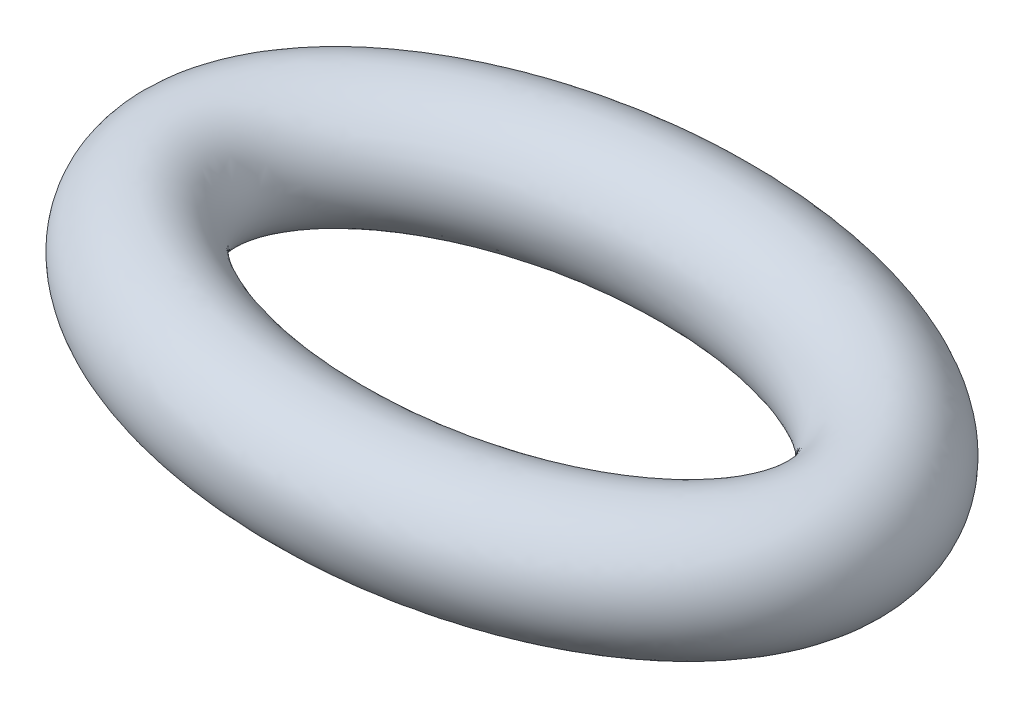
ISO-10303-21;
HEADER;
FILE_DESCRIPTION(('STEP AP214'),'2;1');
FILE_NAME('part.step','',(''),(''),'','','');
FILE_SCHEMA(('AUTOMOTIVE_DESIGN { 1 0 10303 214 1 1 1 1 }'));
ENDSEC;
DATA;
#1=APPLICATION_CONTEXT('core data for automotive mechanical design processes');
#2=APPLICATION_PROTOCOL_DEFINITION('international standard','automotive_design',2000,#1);
#3=PRODUCT_CONTEXT('',#1,'mechanical');
#4=PRODUCT('Part','Part','',(#3));
#5=PRODUCT_RELATED_PRODUCT_CATEGORY('part','',(#4));
#6=PRODUCT_DEFINITION_FORMATION('','',#4);
#7=PRODUCT_DEFINITION_CONTEXT('part definition',#1,'design');
#8=PRODUCT_DEFINITION('design','',#6,#7);
#9=PRODUCT_DEFINITION_SHAPE('','',#8);
#10=(LENGTH_UNIT() NAMED_UNIT(*) SI_UNIT(.MILLI.,.METRE.));
#11=(NAMED_UNIT(*) PLANE_ANGLE_UNIT() SI_UNIT($,.RADIAN.));
#12=(NAMED_UNIT(*) SI_UNIT($,.STERADIAN.) SOLID_ANGLE_UNIT());
#13=UNCERTAINTY_MEASURE_WITH_UNIT(LENGTH_MEASURE(1.E-05),#10,'distance_accuracy_value','');
#14=(GEOMETRIC_REPRESENTATION_CONTEXT(3) GLOBAL_UNCERTAINTY_ASSIGNED_CONTEXT((#13)) GLOBAL_UNIT_ASSIGNED_CONTEXT((#10,
#11,#12)) REPRESENTATION_CONTEXT('',''));
#15=CARTESIAN_POINT('',(0.,0.,0.));
#16=DIRECTION('',(0.,0.,1.));
#17=DIRECTION('',(1.,0.,0.));
#18=AXIS2_PLACEMENT_3D('',#15,#16,#17);
#19=CARTESIAN_POINT('',(19.05,0.,0.));
#20=CARTESIAN_POINT('',(19.05,0.,-0.289543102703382));
#21=CARTESIAN_POINT('',(19.0202153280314,0.,-0.897157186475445));
#22=CARTESIAN_POINT('',(18.8764352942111,0.,-1.84239331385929));
#23=CARTESIAN_POINT('',(18.6067299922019,0.,-2.85465788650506));
#24=CARTESIAN_POINT('',(18.1843672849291,0.,-3.92442798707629));
#25=CARTESIAN_POINT('',(17.5816755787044,0.,-5.03801641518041));
#26=CARTESIAN_POINT('',(16.770433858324,0.,-6.17835651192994));
#27=CARTESIAN_POINT('',(15.6492353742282,0.,-7.40470548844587));
#28=CARTESIAN_POINT('',(14.1368359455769,0.,-8.67305141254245));
#29=CARTESIAN_POINT('',(12.1572226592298,0.,-9.91975937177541));
#30=CARTESIAN_POINT('',(9.73285890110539,0.,-11.0362384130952));
#31=CARTESIAN_POINT('',(6.85431744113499,0.,-11.9453523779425));
#32=CARTESIAN_POINT('',(3.55816578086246,0.,-12.5566286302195));
#33=CARTESIAN_POINT('',(0.,0.,-12.774894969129));
#34=CARTESIAN_POINT('',(-3.55816578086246,0.,-12.5566286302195));
#35=CARTESIAN_POINT('',(-6.85431744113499,0.,-11.9453523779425));
#36=CARTESIAN_POINT('',(-9.73285890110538,0.,-11.0362384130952));
#37=CARTESIAN_POINT('',(-12.1572226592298,0.,-9.91975937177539));
#38=CARTESIAN_POINT('',(-14.1368359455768,0.,-8.67305141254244));
#39=CARTESIAN_POINT('',(-15.6492353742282,0.,-7.40470548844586));
#40=CARTESIAN_POINT('',(-16.770433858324,0.,-6.17835651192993));
#41=CARTESIAN_POINT('',(-17.5816755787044,0.,-5.0380164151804));
#42=CARTESIAN_POINT('',(-18.184367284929,0.,-3.92442798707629));
#43=CARTESIAN_POINT('',(-18.6067299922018,0.,-2.85465788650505));
#44=CARTESIAN_POINT('',(-18.8764352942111,0.,-1.8423933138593));
#45=CARTESIAN_POINT('',(-19.0202153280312,0.,-0.897157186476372));
#46=CARTESIAN_POINT('',(-19.0641931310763,0.,-1.34873512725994E-12));
#47=CARTESIAN_POINT('',(-19.0202153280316,0.,0.897157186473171));
#48=CARTESIAN_POINT('',(-18.8764352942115,0.,1.84239331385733));
#49=CARTESIAN_POINT('',(-18.6067299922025,0.,2.85465788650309));
#50=CARTESIAN_POINT('',(-18.18436728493,0.,3.92442798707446));
#51=CARTESIAN_POINT('',(-17.5816755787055,0.,5.03801641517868));
#52=CARTESIAN_POINT('',(-16.7704338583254,0.,6.17835651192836));
#53=CARTESIAN_POINT('',(-15.6492353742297,0.,7.40470548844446));
#54=CARTESIAN_POINT('',(-14.1368359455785,0.,8.67305141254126));
#55=CARTESIAN_POINT('',(-12.1572226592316,0.,9.91975937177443));
#56=CARTESIAN_POINT('',(-9.73285890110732,0.,11.0362384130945));
#57=CARTESIAN_POINT('',(-6.85431744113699,0.,11.945352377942));
#58=CARTESIAN_POINT('',(-3.55816578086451,0.,12.5566286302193));
#59=CARTESIAN_POINT('',(-2.06062683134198E-12,0.,12.774894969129));
#60=CARTESIAN_POINT('',(3.55816578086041,0.,12.5566286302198));
#61=CARTESIAN_POINT('',(6.85431744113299,0.,11.945352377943));
#62=CARTESIAN_POINT('',(9.73285890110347,0.,11.0362384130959));
#63=CARTESIAN_POINT('',(12.157222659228,0.,9.91975937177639));
#64=CARTESIAN_POINT('',(14.1368359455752,0.,8.67305141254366));
#65=CARTESIAN_POINT('',(15.6492353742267,0.,7.4047054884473));
#66=CARTESIAN_POINT('',(16.7704338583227,0.,6.17835651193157));
#67=CARTESIAN_POINT('',(17.5816755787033,0.,5.03801641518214));
#68=CARTESIAN_POINT('',(18.1843672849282,0.,3.92442798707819));
#69=CARTESIAN_POINT('',(18.6067299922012,0.,2.85465788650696));
#70=CARTESIAN_POINT('',(18.8764352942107,0.,1.8423933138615));
#71=CARTESIAN_POINT('',(19.0202153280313,0.,0.897157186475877));
#72=CARTESIAN_POINT('',(19.05,0.,0.289543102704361));
#73=CARTESIAN_POINT('',(19.05,0.,0.));
#74=CARTESIAN_POINT('',(19.05,6.35,0.));
#75=CARTESIAN_POINT('',(19.05,6.35,-0.289543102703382));
#76=CARTESIAN_POINT('',(19.0202153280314,6.35,-0.897157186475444));
#77=CARTESIAN_POINT('',(18.8764352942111,6.35,-1.84239331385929));
#78=CARTESIAN_POINT('',(18.6067299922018,6.35,-2.85465788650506));
#79=CARTESIAN_POINT('',(18.1843672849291,6.35,-3.92442798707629));
#80=CARTESIAN_POINT('',(17.5816755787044,6.35,-5.03801641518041));
#81=CARTESIAN_POINT('',(16.770433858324,6.35,-6.17835651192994));
#82=CARTESIAN_POINT('',(15.6492353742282,6.35,-7.40470548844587));
#83=CARTESIAN_POINT('',(14.1368359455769,6.35,-8.67305141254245));
#84=CARTESIAN_POINT('',(12.1572226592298,6.35,-9.9197593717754));
#85=CARTESIAN_POINT('',(9.73285890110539,6.35,-11.0362384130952));
#86=CARTESIAN_POINT('',(6.85431744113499,6.35,-11.9453523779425));
#87=CARTESIAN_POINT('',(3.55816578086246,6.35,-12.5566286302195));
#88=CARTESIAN_POINT('',(0.,6.35,-12.774894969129));
#89=CARTESIAN_POINT('',(-3.55816578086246,6.35,-12.5566286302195));
#90=CARTESIAN_POINT('',(-6.85431744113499,6.35,-11.9453523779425));
#91=CARTESIAN_POINT('',(-9.73285890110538,6.35,-11.0362384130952));
#92=CARTESIAN_POINT('',(-12.1572226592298,6.35,-9.9197593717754));
#93=CARTESIAN_POINT('',(-14.1368359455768,6.35,-8.67305141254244));
#94=CARTESIAN_POINT('',(-15.6492353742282,6.35,-7.40470548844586));
#95=CARTESIAN_POINT('',(-16.770433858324,6.35,-6.17835651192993));
#96=CARTESIAN_POINT('',(-17.5816755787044,6.35,-5.03801641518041));
#97=CARTESIAN_POINT('',(-18.184367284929,6.35,-3.92442798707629));
#98=CARTESIAN_POINT('',(-18.6067299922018,6.35,-2.85465788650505));
#99=CARTESIAN_POINT('',(-18.8764352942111,6.35,-1.8423933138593));
#100=CARTESIAN_POINT('',(-19.0202153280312,6.35,-0.897157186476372));
#101=CARTESIAN_POINT('',(-19.0641931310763,6.35,-1.34902580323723E-12));
#102=CARTESIAN_POINT('',(-19.0202153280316,6.35,0.897157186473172));
#103=CARTESIAN_POINT('',(-18.8764352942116,6.35,1.84239331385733));
#104=CARTESIAN_POINT('',(-18.6067299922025,6.35,2.85465788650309));
#105=CARTESIAN_POINT('',(-18.18436728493,6.35,3.92442798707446));
#106=CARTESIAN_POINT('',(-17.5816755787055,6.35,5.03801641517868));
#107=CARTESIAN_POINT('',(-16.7704338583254,6.35,6.17835651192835));
#108=CARTESIAN_POINT('',(-15.6492353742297,6.35,7.40470548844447));
#109=CARTESIAN_POINT('',(-14.1368359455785,6.35,8.67305141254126));
#110=CARTESIAN_POINT('',(-12.1572226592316,6.35,9.91975937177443));
#111=CARTESIAN_POINT('',(-9.73285890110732,6.35,11.0362384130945));
#112=CARTESIAN_POINT('',(-6.85431744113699,6.35,11.945352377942));
#113=CARTESIAN_POINT('',(-3.55816578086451,6.35,12.5566286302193));
#114=CARTESIAN_POINT('',(-2.06115566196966E-12,6.35,12.774894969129));
#115=CARTESIAN_POINT('',(3.55816578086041,6.35,12.5566286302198));
#116=CARTESIAN_POINT('',(6.85431744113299,6.35,11.945352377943));
#117=CARTESIAN_POINT('',(9.73285890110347,6.35,11.0362384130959));
#118=CARTESIAN_POINT('',(12.157222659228,6.35,9.91975937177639));
#119=CARTESIAN_POINT('',(14.1368359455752,6.35,8.67305141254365));
#120=CARTESIAN_POINT('',(15.6492353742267,6.35,7.4047054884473));
#121=CARTESIAN_POINT('',(16.7704338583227,6.35,6.17835651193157));
#122=CARTESIAN_POINT('',(17.5816755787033,6.35,5.03801641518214));
#123=CARTESIAN_POINT('',(18.1843672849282,6.35,3.92442798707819));
#124=CARTESIAN_POINT('',(18.6067299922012,6.35,2.85465788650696));
#125=CARTESIAN_POINT('',(18.8764352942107,6.35,1.8423933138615));
#126=CARTESIAN_POINT('',(19.0202153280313,6.35,0.897157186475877));
#127=CARTESIAN_POINT('',(19.05,6.35,0.289543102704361));
#128=CARTESIAN_POINT('',(19.05,6.35,0.));
#129=CARTESIAN_POINT('',(12.7,6.35,0.));
#130=CARTESIAN_POINT('',(12.7,6.35,-0.0827285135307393));
#131=CARTESIAN_POINT('',(12.6915508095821,6.35,-0.256336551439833));
#132=CARTESIAN_POINT('',(12.6495486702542,6.35,-0.534775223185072));
#133=CARTESIAN_POINT('',(12.5655847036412,6.35,-0.852792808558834));
#134=CARTESIAN_POINT('',(12.4209145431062,6.35,-1.22265335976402));
#135=CARTESIAN_POINT('',(12.1884186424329,6.35,-1.6561513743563));
#136=CARTESIAN_POINT('',(11.8319992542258,6.35,-2.1613677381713));
#137=CARTESIAN_POINT('',(11.2717158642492,6.35,-2.7788847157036));
#138=CARTESIAN_POINT('',(10.412707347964,6.35,-3.50569786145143));
#139=CARTESIAN_POINT('',(9.15178712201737,6.35,-4.30563985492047));
#140=CARTESIAN_POINT('',(7.46586918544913,6.35,-5.0868893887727));
#141=CARTESIAN_POINT('',(5.33507448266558,6.35,-5.76350264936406));
#142=CARTESIAN_POINT('',(2.79578619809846,6.35,-6.23678016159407));
#143=CARTESIAN_POINT('',(0.,6.35,-6.40914427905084));
#144=CARTESIAN_POINT('',(-2.79578619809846,6.35,-6.23678016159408));
#145=CARTESIAN_POINT('',(-5.33507448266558,6.35,-5.76350264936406));
#146=CARTESIAN_POINT('',(-7.46586918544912,6.35,-5.0868893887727));
#147=CARTESIAN_POINT('',(-9.15178712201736,6.35,-4.30563985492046));
#148=CARTESIAN_POINT('',(-10.412707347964,6.35,-3.50569786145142));
#149=CARTESIAN_POINT('',(-11.2717158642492,6.35,-2.77888471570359));
#150=CARTESIAN_POINT('',(-11.8319992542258,6.35,-2.16136773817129));
#151=CARTESIAN_POINT('',(-12.1884186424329,6.35,-1.65615137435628));
#152=CARTESIAN_POINT('',(-12.4209145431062,6.35,-1.222653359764));
#153=CARTESIAN_POINT('',(-12.5655847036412,6.35,-0.85279280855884));
#154=CARTESIAN_POINT('',(-12.6495486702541,6.35,-0.534775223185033));
#155=CARTESIAN_POINT('',(-12.691550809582,6.35,-0.256336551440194));
#156=CARTESIAN_POINT('',(-12.7040262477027,6.35,-1.4770430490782E-12));
#157=CARTESIAN_POINT('',(-12.6915508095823,6.35,0.256336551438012));
#158=CARTESIAN_POINT('',(-12.6495486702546,6.35,0.534775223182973));
#159=CARTESIAN_POINT('',(-12.5655847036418,6.35,0.852792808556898));
#160=CARTESIAN_POINT('',(-12.4209145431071,6.35,1.22265335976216));
#161=CARTESIAN_POINT('',(-12.188418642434,6.35,1.65615137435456));
#162=CARTESIAN_POINT('',(-11.8319992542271,6.35,2.16136773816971));
#163=CARTESIAN_POINT('',(-11.2717158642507,6.35,2.77888471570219));
#164=CARTESIAN_POINT('',(-10.4127073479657,6.35,3.50569786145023));
#165=CARTESIAN_POINT('',(-9.1517871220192,6.35,4.30563985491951));
#166=CARTESIAN_POINT('',(-7.46586918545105,6.35,5.08688938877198));
#167=CARTESIAN_POINT('',(-5.33507448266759,6.35,5.76350264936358));
#168=CARTESIAN_POINT('',(-2.79578619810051,6.35,6.23678016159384));
#169=CARTESIAN_POINT('',(-2.06434397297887E-12,6.35,6.40914427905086));
#170=CARTESIAN_POINT('',(2.79578619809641,6.35,6.23678016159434));
#171=CARTESIAN_POINT('',(5.33507448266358,6.35,5.76350264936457));
#172=CARTESIAN_POINT('',(7.4658691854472,6.35,5.08688938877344));
#173=CARTESIAN_POINT('',(9.15178712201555,6.35,4.30563985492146));
#174=CARTESIAN_POINT('',(10.4127073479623,6.35,3.50569786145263));
#175=CARTESIAN_POINT('',(11.2717158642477,6.35,2.77888471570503));
#176=CARTESIAN_POINT('',(11.8319992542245,6.35,2.16136773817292));
#177=CARTESIAN_POINT('',(12.1884186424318,6.35,1.65615137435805));
#178=CARTESIAN_POINT('',(12.4209145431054,6.35,1.22265335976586));
#179=CARTESIAN_POINT('',(12.5655847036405,6.35,0.852792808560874));
#180=CARTESIAN_POINT('',(12.6495486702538,6.35,0.53477522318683));
#181=CARTESIAN_POINT('',(12.6915508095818,6.35,0.25633655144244));
#182=CARTESIAN_POINT('',(12.7,6.35,0.0827285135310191));
#183=CARTESIAN_POINT('',(12.7,6.35,0.));
#184=CARTESIAN_POINT('',(12.7,0.,0.));
#185=CARTESIAN_POINT('',(12.7,0.,-0.0827285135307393));
#186=CARTESIAN_POINT('',(12.6915508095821,0.,-0.256336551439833));
#187=CARTESIAN_POINT('',(12.6495486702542,0.,-0.534775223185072));
#188=CARTESIAN_POINT('',(12.5655847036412,0.,-0.852792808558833));
#189=CARTESIAN_POINT('',(12.4209145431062,0.,-1.22265335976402));
#190=CARTESIAN_POINT('',(12.1884186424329,0.,-1.65615137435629));
#191=CARTESIAN_POINT('',(11.8319992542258,0.,-2.1613677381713));
#192=CARTESIAN_POINT('',(11.2717158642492,0.,-2.7788847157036));
#193=CARTESIAN_POINT('',(10.412707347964,0.,-3.50569786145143));
#194=CARTESIAN_POINT('',(9.15178712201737,0.,-4.30563985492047));
#195=CARTESIAN_POINT('',(7.46586918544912,0.,-5.08688938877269));
#196=CARTESIAN_POINT('',(5.33507448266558,0.,-5.76350264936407));
#197=CARTESIAN_POINT('',(2.79578619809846,0.,-6.23678016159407));
#198=CARTESIAN_POINT('',(0.,0.,-6.40914427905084));
#199=CARTESIAN_POINT('',(-2.79578619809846,0.,-6.23678016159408));
#200=CARTESIAN_POINT('',(-5.33507448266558,0.,-5.76350264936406));
#201=CARTESIAN_POINT('',(-7.46586918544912,0.,-5.0868893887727));
#202=CARTESIAN_POINT('',(-9.15178712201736,0.,-4.30563985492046));
#203=CARTESIAN_POINT('',(-10.412707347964,0.,-3.50569786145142));
#204=CARTESIAN_POINT('',(-11.2717158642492,0.,-2.77888471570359));
#205=CARTESIAN_POINT('',(-11.8319992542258,0.,-2.16136773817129));
#206=CARTESIAN_POINT('',(-12.1884186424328,0.,-1.65615137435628));
#207=CARTESIAN_POINT('',(-12.4209145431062,0.,-1.222653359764));
#208=CARTESIAN_POINT('',(-12.5655847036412,0.,-0.852792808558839));
#209=CARTESIAN_POINT('',(-12.6495486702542,0.,-0.534775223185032));
#210=CARTESIAN_POINT('',(-12.691550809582,0.,-0.256336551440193));
#211=CARTESIAN_POINT('',(-12.7040262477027,0.,-1.47697038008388E-12));
#212=CARTESIAN_POINT('',(-12.6915508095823,0.,0.256336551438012));
#213=CARTESIAN_POINT('',(-12.6495486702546,0.,0.534775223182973));
#214=CARTESIAN_POINT('',(-12.5655847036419,0.,0.852792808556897));
#215=CARTESIAN_POINT('',(-12.4209145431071,0.,1.22265335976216));
#216=CARTESIAN_POINT('',(-12.188418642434,0.,1.65615137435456));
#217=CARTESIAN_POINT('',(-11.8319992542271,0.,2.16136773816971));
#218=CARTESIAN_POINT('',(-11.2717158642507,0.,2.77888471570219));
#219=CARTESIAN_POINT('',(-10.4127073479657,0.,3.50569786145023));
#220=CARTESIAN_POINT('',(-9.1517871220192,0.,4.3056398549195));
#221=CARTESIAN_POINT('',(-7.46586918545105,0.,5.08688938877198));
#222=CARTESIAN_POINT('',(-5.33507448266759,0.,5.76350264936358));
#223=CARTESIAN_POINT('',(-2.79578619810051,0.,6.23678016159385));
#224=CARTESIAN_POINT('',(-2.06425583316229E-12,0.,6.40914427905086));
#225=CARTESIAN_POINT('',(2.79578619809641,0.,6.23678016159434));
#226=CARTESIAN_POINT('',(5.33507448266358,0.,5.76350264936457));
#227=CARTESIAN_POINT('',(7.4658691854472,0.,5.08688938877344));
#228=CARTESIAN_POINT('',(9.15178712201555,0.,4.30563985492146));
#229=CARTESIAN_POINT('',(10.4127073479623,0.,3.50569786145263));
#230=CARTESIAN_POINT('',(11.2717158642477,0.,2.77888471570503));
#231=CARTESIAN_POINT('',(11.8319992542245,0.,2.16136773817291));
#232=CARTESIAN_POINT('',(12.1884186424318,0.,1.65615137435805));
#233=CARTESIAN_POINT('',(12.4209145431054,0.,1.22265335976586));
#234=CARTESIAN_POINT('',(12.5655847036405,0.,0.852792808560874));
#235=CARTESIAN_POINT('',(12.6495486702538,0.,0.53477522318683));
#236=CARTESIAN_POINT('',(12.6915508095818,0.,0.256336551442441));
#237=CARTESIAN_POINT('',(12.7,0.,0.0827285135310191));
#238=CARTESIAN_POINT('',(12.7,0.,0.));
#239=CARTESIAN_POINT('',(12.7,-6.35,0.));
#240=CARTESIAN_POINT('',(12.7,-6.35,-0.0827285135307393));
#241=CARTESIAN_POINT('',(12.6915508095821,-6.35,-0.256336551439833));
#242=CARTESIAN_POINT('',(12.6495486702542,-6.35,-0.534775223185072));
#243=CARTESIAN_POINT('',(12.5655847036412,-6.35,-0.852792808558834));
#244=CARTESIAN_POINT('',(12.4209145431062,-6.35,-1.22265335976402));
#245=CARTESIAN_POINT('',(12.1884186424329,-6.35,-1.6561513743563));
#246=CARTESIAN_POINT('',(11.8319992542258,-6.35,-2.1613677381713));
#247=CARTESIAN_POINT('',(11.2717158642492,-6.35,-2.7788847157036));
#248=CARTESIAN_POINT('',(10.412707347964,-6.35,-3.50569786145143));
#249=CARTESIAN_POINT('',(9.15178712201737,-6.35,-4.30563985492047));
#250=CARTESIAN_POINT('',(7.46586918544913,-6.35,-5.0868893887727));
#251=CARTESIAN_POINT('',(5.33507448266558,-6.35,-5.76350264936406));
#252=CARTESIAN_POINT('',(2.79578619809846,-6.35,-6.23678016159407));
#253=CARTESIAN_POINT('',(0.,-6.35,-6.40914427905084));
#254=CARTESIAN_POINT('',(-2.79578619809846,-6.35,-6.23678016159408));
#255=CARTESIAN_POINT('',(-5.33507448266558,-6.35,-5.76350264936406));
#256=CARTESIAN_POINT('',(-7.46586918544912,-6.35,-5.0868893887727));
#257=CARTESIAN_POINT('',(-9.15178712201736,-6.35,-4.30563985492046));
#258=CARTESIAN_POINT('',(-10.412707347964,-6.35,-3.50569786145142));
#259=CARTESIAN_POINT('',(-11.2717158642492,-6.35,-2.77888471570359));
#260=CARTESIAN_POINT('',(-11.8319992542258,-6.35,-2.16136773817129));
#261=CARTESIAN_POINT('',(-12.1884186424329,-6.35,-1.65615137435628));
#262=CARTESIAN_POINT('',(-12.4209145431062,-6.35,-1.222653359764));
#263=CARTESIAN_POINT('',(-12.5655847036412,-6.35,-0.85279280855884));
#264=CARTESIAN_POINT('',(-12.6495486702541,-6.35,-0.534775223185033));
#265=CARTESIAN_POINT('',(-12.691550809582,-6.35,-0.256336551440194));
#266=CARTESIAN_POINT('',(-12.7040262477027,-6.35,-1.4770430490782E-12));
#267=CARTESIAN_POINT('',(-12.6915508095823,-6.35,0.256336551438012));
#268=CARTESIAN_POINT('',(-12.6495486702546,-6.35,0.534775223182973));
#269=CARTESIAN_POINT('',(-12.5655847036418,-6.35,0.852792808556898));
#270=CARTESIAN_POINT('',(-12.4209145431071,-6.35,1.22265335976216));
#271=CARTESIAN_POINT('',(-12.188418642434,-6.35,1.65615137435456));
#272=CARTESIAN_POINT('',(-11.8319992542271,-6.35,2.16136773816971));
#273=CARTESIAN_POINT('',(-11.2717158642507,-6.35,2.77888471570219));
#274=CARTESIAN_POINT('',(-10.4127073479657,-6.35,3.50569786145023));
#275=CARTESIAN_POINT('',(-9.1517871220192,-6.35,4.30563985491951));
#276=CARTESIAN_POINT('',(-7.46586918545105,-6.35,5.08688938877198));
#277=CARTESIAN_POINT('',(-5.33507448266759,-6.35,5.76350264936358));
#278=CARTESIAN_POINT('',(-2.79578619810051,-6.35,6.23678016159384));
#279=CARTESIAN_POINT('',(-2.06434397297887E-12,-6.35,6.40914427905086));
#280=CARTESIAN_POINT('',(2.79578619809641,-6.35,6.23678016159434));
#281=CARTESIAN_POINT('',(5.33507448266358,-6.35,5.76350264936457));
#282=CARTESIAN_POINT('',(7.4658691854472,-6.35,5.08688938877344));
#283=CARTESIAN_POINT('',(9.15178712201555,-6.35,4.30563985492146));
#284=CARTESIAN_POINT('',(10.4127073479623,-6.35,3.50569786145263));
#285=CARTESIAN_POINT('',(11.2717158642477,-6.35,2.77888471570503));
#286=CARTESIAN_POINT('',(11.8319992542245,-6.35,2.16136773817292));
#287=CARTESIAN_POINT('',(12.1884186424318,-6.35,1.65615137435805));
#288=CARTESIAN_POINT('',(12.4209145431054,-6.35,1.22265335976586));
#289=CARTESIAN_POINT('',(12.5655847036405,-6.35,0.852792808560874));
#290=CARTESIAN_POINT('',(12.6495486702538,-6.35,0.53477522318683));
#291=CARTESIAN_POINT('',(12.6915508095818,-6.35,0.25633655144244));
#292=CARTESIAN_POINT('',(12.7,-6.35,0.0827285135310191));
#293=CARTESIAN_POINT('',(12.7,-6.35,0.));
#294=CARTESIAN_POINT('',(19.05,-6.35,0.));
#295=CARTESIAN_POINT('',(19.05,-6.35,-0.289543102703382));
#296=CARTESIAN_POINT('',(19.0202153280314,-6.35,-0.897157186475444));
#297=CARTESIAN_POINT('',(18.8764352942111,-6.35,-1.84239331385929));
#298=CARTESIAN_POINT('',(18.6067299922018,-6.35,-2.85465788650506));
#299=CARTESIAN_POINT('',(18.1843672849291,-6.35,-3.92442798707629));
#300=CARTESIAN_POINT('',(17.5816755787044,-6.35,-5.03801641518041));
#301=CARTESIAN_POINT('',(16.770433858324,-6.35,-6.17835651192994));
#302=CARTESIAN_POINT('',(15.6492353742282,-6.35,-7.40470548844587));
#303=CARTESIAN_POINT('',(14.1368359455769,-6.35,-8.67305141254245));
#304=CARTESIAN_POINT('',(12.1572226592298,-6.35,-9.9197593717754));
#305=CARTESIAN_POINT('',(9.73285890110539,-6.35,-11.0362384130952));
#306=CARTESIAN_POINT('',(6.85431744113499,-6.35,-11.9453523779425));
#307=CARTESIAN_POINT('',(3.55816578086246,-6.35,-12.5566286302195));
#308=CARTESIAN_POINT('',(0.,-6.35,-12.774894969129));
#309=CARTESIAN_POINT('',(-3.55816578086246,-6.35,-12.5566286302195));
#310=CARTESIAN_POINT('',(-6.85431744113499,-6.35,-11.9453523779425));
#311=CARTESIAN_POINT('',(-9.73285890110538,-6.35,-11.0362384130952));
#312=CARTESIAN_POINT('',(-12.1572226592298,-6.35,-9.9197593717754));
#313=CARTESIAN_POINT('',(-14.1368359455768,-6.35,-8.67305141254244));
#314=CARTESIAN_POINT('',(-15.6492353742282,-6.35,-7.40470548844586));
#315=CARTESIAN_POINT('',(-16.770433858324,-6.35,-6.17835651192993));
#316=CARTESIAN_POINT('',(-17.5816755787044,-6.35,-5.03801641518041));
#317=CARTESIAN_POINT('',(-18.184367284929,-6.35,-3.92442798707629));
#318=CARTESIAN_POINT('',(-18.6067299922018,-6.35,-2.85465788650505));
#319=CARTESIAN_POINT('',(-18.8764352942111,-6.35,-1.8423933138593));
#320=CARTESIAN_POINT('',(-19.0202153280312,-6.35,-0.897157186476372));
#321=CARTESIAN_POINT('',(-19.0641931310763,-6.35,-1.34902580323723E-12));
#322=CARTESIAN_POINT('',(-19.0202153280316,-6.35,0.897157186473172));
#323=CARTESIAN_POINT('',(-18.8764352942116,-6.35,1.84239331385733));
#324=CARTESIAN_POINT('',(-18.6067299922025,-6.35,2.85465788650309));
#325=CARTESIAN_POINT('',(-18.18436728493,-6.35,3.92442798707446));
#326=CARTESIAN_POINT('',(-17.5816755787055,-6.35,5.03801641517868));
#327=CARTESIAN_POINT('',(-16.7704338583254,-6.35,6.17835651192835));
#328=CARTESIAN_POINT('',(-15.6492353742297,-6.35,7.40470548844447));
#329=CARTESIAN_POINT('',(-14.1368359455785,-6.35,8.67305141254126));
#330=CARTESIAN_POINT('',(-12.1572226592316,-6.35,9.91975937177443));
#331=CARTESIAN_POINT('',(-9.73285890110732,-6.35,11.0362384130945));
#332=CARTESIAN_POINT('',(-6.85431744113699,-6.35,11.945352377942));
#333=CARTESIAN_POINT('',(-3.55816578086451,-6.35,12.5566286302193));
#334=CARTESIAN_POINT('',(-2.06115566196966E-12,-6.35,12.774894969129));
#335=CARTESIAN_POINT('',(3.55816578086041,-6.35,12.5566286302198));
#336=CARTESIAN_POINT('',(6.85431744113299,-6.35,11.945352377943));
#337=CARTESIAN_POINT('',(9.73285890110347,-6.35,11.0362384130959));
#338=CARTESIAN_POINT('',(12.157222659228,-6.35,9.91975937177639));
#339=CARTESIAN_POINT('',(14.1368359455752,-6.35,8.67305141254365));
#340=CARTESIAN_POINT('',(15.6492353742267,-6.35,7.4047054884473));
#341=CARTESIAN_POINT('',(16.7704338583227,-6.35,6.17835651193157));
#342=CARTESIAN_POINT('',(17.5816755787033,-6.35,5.03801641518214));
#343=CARTESIAN_POINT('',(18.1843672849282,-6.35,3.92442798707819));
#344=CARTESIAN_POINT('',(18.6067299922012,-6.35,2.85465788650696));
#345=CARTESIAN_POINT('',(18.8764352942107,-6.35,1.8423933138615));
#346=CARTESIAN_POINT('',(19.0202153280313,-6.35,0.897157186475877));
#347=CARTESIAN_POINT('',(19.05,-6.35,0.289543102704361));
#348=CARTESIAN_POINT('',(19.05,-6.35,0.));
#349=CARTESIAN_POINT('',(19.05,0.,0.));
#350=CARTESIAN_POINT('',(19.05,0.,-0.289543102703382));
#351=CARTESIAN_POINT('',(19.0202153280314,0.,-0.897157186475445));
#352=CARTESIAN_POINT('',(18.8764352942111,0.,-1.84239331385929));
#353=CARTESIAN_POINT('',(18.6067299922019,0.,-2.85465788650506));
#354=CARTESIAN_POINT('',(18.1843672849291,0.,-3.92442798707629));
#355=CARTESIAN_POINT('',(17.5816755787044,0.,-5.03801641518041));
#356=CARTESIAN_POINT('',(16.770433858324,0.,-6.17835651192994));
#357=CARTESIAN_POINT('',(15.6492353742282,0.,-7.40470548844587));
#358=CARTESIAN_POINT('',(14.1368359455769,0.,-8.67305141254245));
#359=CARTESIAN_POINT('',(12.1572226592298,0.,-9.91975937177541));
#360=CARTESIAN_POINT('',(9.73285890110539,0.,-11.0362384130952));
#361=CARTESIAN_POINT('',(6.85431744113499,0.,-11.9453523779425));
#362=CARTESIAN_POINT('',(3.55816578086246,0.,-12.5566286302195));
#363=CARTESIAN_POINT('',(0.,0.,-12.774894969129));
#364=CARTESIAN_POINT('',(-3.55816578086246,0.,-12.5566286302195));
#365=CARTESIAN_POINT('',(-6.85431744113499,0.,-11.9453523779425));
#366=CARTESIAN_POINT('',(-9.73285890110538,0.,-11.0362384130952));
#367=CARTESIAN_POINT('',(-12.1572226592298,0.,-9.91975937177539));
#368=CARTESIAN_POINT('',(-14.1368359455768,0.,-8.67305141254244));
#369=CARTESIAN_POINT('',(-15.6492353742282,0.,-7.40470548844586));
#370=CARTESIAN_POINT('',(-16.770433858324,0.,-6.17835651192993));
#371=CARTESIAN_POINT('',(-17.5816755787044,0.,-5.0380164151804));
#372=CARTESIAN_POINT('',(-18.184367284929,0.,-3.92442798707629));
#373=CARTESIAN_POINT('',(-18.6067299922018,0.,-2.85465788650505));
#374=CARTESIAN_POINT('',(-18.8764352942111,0.,-1.8423933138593));
#375=CARTESIAN_POINT('',(-19.0202153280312,0.,-0.897157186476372));
#376=CARTESIAN_POINT('',(-19.0641931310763,0.,-1.34873512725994E-12));
#377=CARTESIAN_POINT('',(-19.0202153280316,0.,0.897157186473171));
#378=CARTESIAN_POINT('',(-18.8764352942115,0.,1.84239331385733));
#379=CARTESIAN_POINT('',(-18.6067299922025,0.,2.85465788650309));
#380=CARTESIAN_POINT('',(-18.18436728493,0.,3.92442798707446));
#381=CARTESIAN_POINT('',(-17.5816755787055,0.,5.03801641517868));
#382=CARTESIAN_POINT('',(-16.7704338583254,0.,6.17835651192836));
#383=CARTESIAN_POINT('',(-15.6492353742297,0.,7.40470548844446));
#384=CARTESIAN_POINT('',(-14.1368359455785,0.,8.67305141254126));
#385=CARTESIAN_POINT('',(-12.1572226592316,0.,9.91975937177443));
#386=CARTESIAN_POINT('',(-9.73285890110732,0.,11.0362384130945));
#387=CARTESIAN_POINT('',(-6.85431744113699,0.,11.945352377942));
#388=CARTESIAN_POINT('',(-3.55816578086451,0.,12.5566286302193));
#389=CARTESIAN_POINT('',(-2.06062683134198E-12,0.,12.774894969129));
#390=CARTESIAN_POINT('',(3.55816578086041,0.,12.5566286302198));
#391=CARTESIAN_POINT('',(6.85431744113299,0.,11.945352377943));
#392=CARTESIAN_POINT('',(9.73285890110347,0.,11.0362384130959));
#393=CARTESIAN_POINT('',(12.157222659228,0.,9.91975937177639));
#394=CARTESIAN_POINT('',(14.1368359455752,0.,8.67305141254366));
#395=CARTESIAN_POINT('',(15.6492353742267,0.,7.4047054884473));
#396=CARTESIAN_POINT('',(16.7704338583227,0.,6.17835651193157));
#397=CARTESIAN_POINT('',(17.5816755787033,0.,5.03801641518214));
#398=CARTESIAN_POINT('',(18.1843672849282,0.,3.92442798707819));
#399=CARTESIAN_POINT('',(18.6067299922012,0.,2.85465788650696));
#400=CARTESIAN_POINT('',(18.8764352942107,0.,1.8423933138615));
#401=CARTESIAN_POINT('',(19.0202153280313,0.,0.897157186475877));
#402=CARTESIAN_POINT('',(19.05,0.,0.289543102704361));
#403=CARTESIAN_POINT('',(19.05,0.,0.));
#404=(BOUNDED_SURFACE() B_SPLINE_SURFACE(3,3,((#19,#20,#21,#22,#23,#24,#25,#26,#27,#28,#29,#30,
#31,#32,#33,#34,#35,#36,#37,#38,#39,#40,#41,#42,#43,#44,#45,#46,#47,#48,#49,#50,#51,#52,#53,#54,
#55,#56,#57,#58,#59,#60,#61,#62,#63,#64,#65,#66,#67,#68,#69,#70,#71,#72,#73),(#74,#75,#76,#77,
#78,#79,#80,#81,#82,#83,#84,#85,#86,#87,#88,#89,#90,#91,#92,#93,#94,#95,#96,#97,#98,#99,#100,
#101,#102,#103,#104,#105,#106,#107,#108,#109,#110,#111,#112,#113,#114,#115,#116,#117,#118,#119,
#120,#121,#122,#123,#124,#125,#126,#127,#128),(#129,#130,#131,#132,#133,#134,#135,#136,#137,
#138,#139,#140,#141,#142,#143,#144,#145,#146,#147,#148,#149,#150,#151,#152,#153,#154,#155,#156,
#157,#158,#159,#160,#161,#162,#163,#164,#165,#166,#167,#168,#169,#170,#171,#172,#173,#174,#175,
#176,#177,#178,#179,#180,#181,#182,#183),(#184,#185,#186,#187,#188,#189,#190,#191,#192,#193,
#194,#195,#196,#197,#198,#199,#200,#201,#202,#203,#204,#205,#206,#207,#208,#209,#210,#211,#212,
#213,#214,#215,#216,#217,#218,#219,#220,#221,#222,#223,#224,#225,#226,#227,#228,#229,#230,#231,
#232,#233,#234,#235,#236,#237,#238),(#239,#240,#241,#242,#243,#244,#245,#246,#247,#248,#249,
#250,#251,#252,#253,#254,#255,#256,#257,#258,#259,#260,#261,#262,#263,#264,#265,#266,#267,#268,
#269,#270,#271,#272,#273,#274,#275,#276,#277,#278,#279,#280,#281,#282,#283,#284,#285,#286,#287,
#288,#289,#290,#291,#292,#293),(#294,#295,#296,#297,#298,#299,#300,#301,#302,#303,#304,#305,
#306,#307,#308,#309,#310,#311,#312,#313,#314,#315,#316,#317,#318,#319,#320,#321,#322,#323,#324,
#325,#326,#327,#328,#329,#330,#331,#332,#333,#334,#335,#336,#337,#338,#339,#340,#341,#342,#343,
#344,#345,#346,#347,#348),(#349,#350,#351,#352,#353,#354,#355,#356,#357,#358,#359,#360,#361,
#362,#363,#364,#365,#366,#367,#368,#369,#370,#371,#372,#373,#374,#375,#376,#377,#378,#379,#380,
#381,#382,#383,#384,#385,#386,#387,#388,#389,#390,#391,#392,#393,#394,#395,#396,#397,#398,#399,
#400,#401,#402,#403)),.UNSPECIFIED.,.T.,.T.,.F.) B_SPLINE_SURFACE_WITH_KNOTS((4,3,4),(4,1,1,1,1,
1,1,1,1,1,1,1,1,1,1,1,1,1,1,1,1,1,1,1,1,1,1,1,1,1,1,1,1,1,1,1,1,1,1,1,1,1,1,1,1,1,1,1,1,1,1,1,
4),(0.,0.5,1.),(0.,0.00718593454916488,0.015079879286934,0.023822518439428,0.033593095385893,
0.044617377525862,0.0571735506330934,0.0715925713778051,0.0912647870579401,0.114595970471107,
0.142117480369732,0.174103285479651,0.210352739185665,0.25,0.289647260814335,0.325896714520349,
0.357882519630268,0.385404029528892,0.40873521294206,0.428407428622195,0.442826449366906,
0.455382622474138,0.466406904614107,0.476177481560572,0.484920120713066,0.492814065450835,
0.499999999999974,0.50718593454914,0.515079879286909,0.523822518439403,0.533593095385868,
0.544617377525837,0.557173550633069,0.57159257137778,0.591264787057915,0.614595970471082,
0.642117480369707,0.674103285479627,0.71035273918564,0.749999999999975,0.789647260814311,
0.825896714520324,0.857882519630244,0.885404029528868,0.908735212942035,0.92840742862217,
0.942826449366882,0.955382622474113,0.966406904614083,0.976177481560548,0.984920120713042,
0.992814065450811,1.),
.UNSPECIFIED.) GEOMETRIC_REPRESENTATION_ITEM() RATIONAL_B_SPLINE_SURFACE(((1.,1.,1.,1.,1.,1.,1.,
1.,1.,1.,1.,1.,1.,1.,1.,1.,1.,1.,1.,1.,1.,1.,1.,1.,1.,1.,1.,1.,1.,1.,1.,1.,1.,1.,1.,1.,1.,1.,1.,
1.,1.,1.,1.,1.,1.,1.,1.,1.,1.,1.,1.,1.,1.,1.,1.),(0.333333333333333,0.333333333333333,
0.333333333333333,0.333333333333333,0.333333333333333,0.333333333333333,0.333333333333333,
0.333333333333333,0.333333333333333,0.333333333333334,0.333333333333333,0.333333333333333,
0.333333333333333,0.333333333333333,0.333333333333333,0.333333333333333,0.333333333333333,
0.333333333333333,0.333333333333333,0.333333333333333,0.333333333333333,0.333333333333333,
0.333333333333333,0.333333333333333,0.333333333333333,0.333333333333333,0.333333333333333,
0.333333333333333,0.333333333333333,0.333333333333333,0.333333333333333,0.333333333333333,
0.333333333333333,0.333333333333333,0.333333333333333,0.333333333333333,0.333333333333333,
0.333333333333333,0.333333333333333,0.333333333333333,0.333333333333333,0.333333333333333,
0.333333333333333,0.333333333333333,0.333333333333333,0.333333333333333,0.333333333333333,
0.333333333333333,0.333333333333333,0.333333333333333,0.333333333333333,0.333333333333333,
0.333333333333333,0.333333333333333,0.333333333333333),(0.333333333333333,0.333333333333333,
0.333333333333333,0.333333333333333,0.333333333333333,0.333333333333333,0.333333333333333,
0.333333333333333,0.333333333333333,0.333333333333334,0.333333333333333,0.333333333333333,
0.333333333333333,0.333333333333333,0.333333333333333,0.333333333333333,0.333333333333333,
0.333333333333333,0.333333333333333,0.333333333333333,0.333333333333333,0.333333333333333,
0.333333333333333,0.333333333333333,0.333333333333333,0.333333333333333,0.333333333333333,
0.333333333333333,0.333333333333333,0.333333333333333,0.333333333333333,0.333333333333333,
0.333333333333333,0.333333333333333,0.333333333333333,0.333333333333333,0.333333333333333,
0.333333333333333,0.333333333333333,0.333333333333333,0.333333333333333,0.333333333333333,
0.333333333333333,0.333333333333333,0.333333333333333,0.333333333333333,0.333333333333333,
0.333333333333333,0.333333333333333,0.333333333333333,0.333333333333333,0.333333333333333,
0.333333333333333,0.333333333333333,0.333333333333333),(1.,1.,1.,1.,1.,1.,1.,1.,1.,1.,1.,1.,1.,
1.,1.,1.,1.,1.,1.,1.,1.,1.,1.,1.,1.,1.,1.,1.,1.,1.,1.,1.,1.,1.,1.,1.,1.,1.,1.,1.,1.,1.,1.,1.,1.,
1.,1.,1.,1.,1.,1.,1.,1.,1.,1.),(0.333333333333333,0.333333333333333,0.333333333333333,
0.333333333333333,0.333333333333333,0.333333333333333,0.333333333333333,0.333333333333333,
0.333333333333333,0.333333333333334,0.333333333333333,0.333333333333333,0.333333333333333,
0.333333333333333,0.333333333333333,0.333333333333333,0.333333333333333,0.333333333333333,
0.333333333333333,0.333333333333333,0.333333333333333,0.333333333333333,0.333333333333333,
0.333333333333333,0.333333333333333,0.333333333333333,0.333333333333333,0.333333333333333,
0.333333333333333,0.333333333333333,0.333333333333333,0.333333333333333,0.333333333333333,
0.333333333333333,0.333333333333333,0.333333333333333,0.333333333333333,0.333333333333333,
0.333333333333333,0.333333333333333,0.333333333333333,0.333333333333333,0.333333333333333,
0.333333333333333,0.333333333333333,0.333333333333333,0.333333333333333,0.333333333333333,
0.333333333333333,0.333333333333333,0.333333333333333,0.333333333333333,0.333333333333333,
0.333333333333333,0.333333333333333),(0.333333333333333,0.333333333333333,0.333333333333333,
0.333333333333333,0.333333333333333,0.333333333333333,0.333333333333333,0.333333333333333,
0.333333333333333,0.333333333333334,0.333333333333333,0.333333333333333,0.333333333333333,
0.333333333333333,0.333333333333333,0.333333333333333,0.333333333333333,0.333333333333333,
0.333333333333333,0.333333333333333,0.333333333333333,0.333333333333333,0.333333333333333,
0.333333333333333,0.333333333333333,0.333333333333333,0.333333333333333,0.333333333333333,
0.333333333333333,0.333333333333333,0.333333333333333,0.333333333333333,0.333333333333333,
0.333333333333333,0.333333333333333,0.333333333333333,0.333333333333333,0.333333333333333,
0.333333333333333,0.333333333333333,0.333333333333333,0.333333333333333,0.333333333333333,
0.333333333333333,0.333333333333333,0.333333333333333,0.333333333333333,0.333333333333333,
0.333333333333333,0.333333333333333,0.333333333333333,0.333333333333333,0.333333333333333,
0.333333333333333,0.333333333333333),(1.,1.,1.,1.,1.,1.,1.,1.,1.,1.,1.,1.,1.,1.,1.,1.,1.,1.,1.,
1.,1.,1.,1.,1.,1.,1.,1.,1.,1.,1.,1.,1.,1.,1.,1.,1.,1.,1.,1.,1.,1.,1.,1.,1.,1.,1.,1.,1.,1.,1.,1.,
1.,1.,1.,1.))) REPRESENTATION_ITEM('') SURFACE());
#405=ADVANCED_FACE('F35',(),#404,.F.);
#406=CLOSED_SHELL('',(#405));
#407=MANIFOLD_SOLID_BREP('B2',#406);
#408=ADVANCED_BREP_SHAPE_REPRESENTATION('',(#18,#407),#14);
#409=SHAPE_DEFINITION_REPRESENTATION(#9,#408);
ENDSEC;
END-ISO-10303-21;
